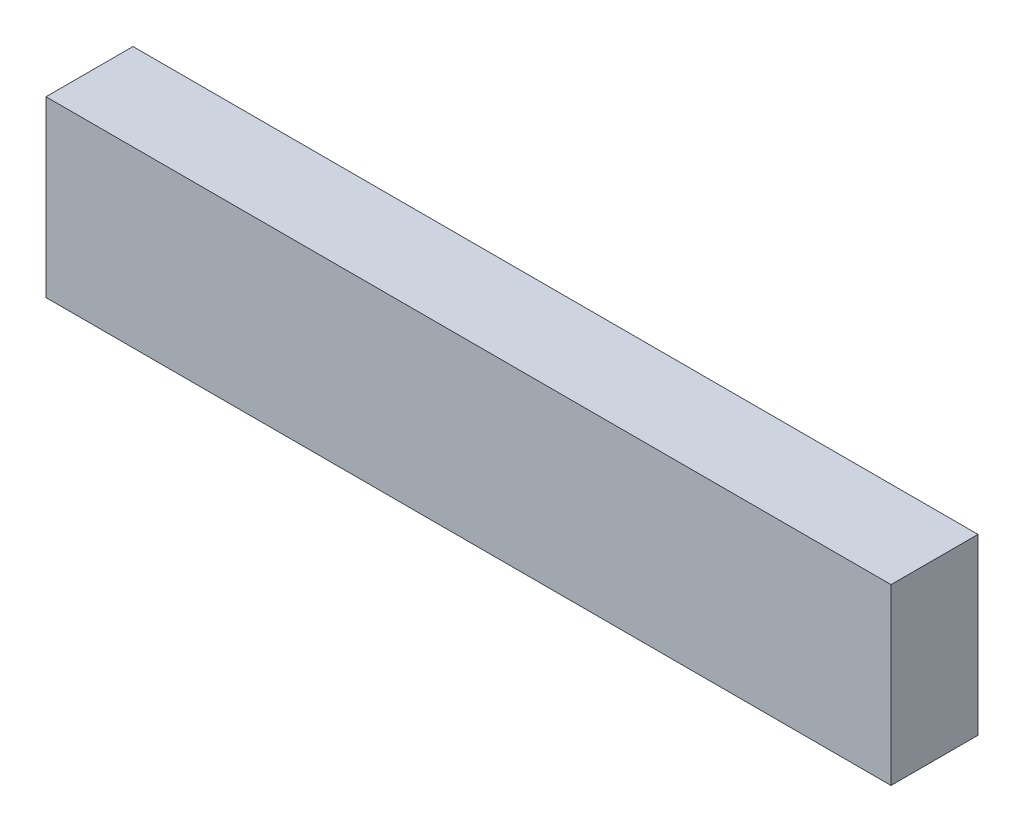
ISO-10303-21;
HEADER;
FILE_DESCRIPTION(('STEP AP214'),'2;1');
FILE_NAME('part.step','',(''),(''),'','','');
FILE_SCHEMA(('AUTOMOTIVE_DESIGN { 1 0 10303 214 1 1 1 1 }'));
ENDSEC;
DATA;
#1=APPLICATION_CONTEXT('core data for automotive mechanical design processes');
#2=APPLICATION_PROTOCOL_DEFINITION('international standard','automotive_design',2000,#1);
#3=PRODUCT_CONTEXT('',#1,'mechanical');
#4=PRODUCT('Part','Part','',(#3));
#5=PRODUCT_RELATED_PRODUCT_CATEGORY('part','',(#4));
#6=PRODUCT_DEFINITION_FORMATION('','',#4);
#7=PRODUCT_DEFINITION_CONTEXT('part definition',#1,'design');
#8=PRODUCT_DEFINITION('design','',#6,#7);
#9=PRODUCT_DEFINITION_SHAPE('','',#8);
#10=(LENGTH_UNIT() NAMED_UNIT(*) SI_UNIT(.MILLI.,.METRE.));
#11=(NAMED_UNIT(*) PLANE_ANGLE_UNIT() SI_UNIT($,.RADIAN.));
#12=(NAMED_UNIT(*) SI_UNIT($,.STERADIAN.) SOLID_ANGLE_UNIT());
#13=UNCERTAINTY_MEASURE_WITH_UNIT(LENGTH_MEASURE(1.E-05),#10,'distance_accuracy_value','');
#14=(GEOMETRIC_REPRESENTATION_CONTEXT(3) GLOBAL_UNCERTAINTY_ASSIGNED_CONTEXT((#13)) GLOBAL_UNIT_ASSIGNED_CONTEXT((#10,
#11,#12)) REPRESENTATION_CONTEXT('',''));
#15=CARTESIAN_POINT('',(0.,0.,0.));
#16=DIRECTION('',(0.,0.,1.));
#17=DIRECTION('',(1.,0.,0.));
#18=AXIS2_PLACEMENT_3D('',#15,#16,#17);
#19=CARTESIAN_POINT('',(-3.39999828,0.70000114,0.70000114));
#20=DIRECTION('',(0.,0.,1.));
#21=DIRECTION('',(1.,0.,0.));
#22=AXIS2_PLACEMENT_3D('',#19,#20,#21);
#23=PLANE('',#22);
#24=DIRECTION('',(0.,1.,0.));
#25=VECTOR('',#24,1.);
#26=CARTESIAN_POINT('',(3.40000082,0.70000114,0.70000114));
#27=LINE('',#26,#25);
#28=CARTESIAN_POINT('',(3.40000082,0.70000114,0.70000114));
#29=VERTEX_POINT('',#28);
#30=CARTESIAN_POINT('',(3.40000082,-0.6999986,0.70000114));
#31=VERTEX_POINT('',#30);
#32=EDGE_CURVE('E53',#29,#31,#27,.F.);
#33=ORIENTED_EDGE('',*,*,#32,.F.);
#34=DIRECTION('',(1.,0.,0.));
#35=VECTOR('',#34,1.);
#36=CARTESIAN_POINT('',(-3.39999828,0.70000114,0.70000114));
#37=LINE('',#36,#35);
#38=CARTESIAN_POINT('',(-3.39999828,0.70000114,0.70000114));
#39=VERTEX_POINT('',#38);
#40=EDGE_CURVE('E68',#39,#29,#37,.T.);
#41=ORIENTED_EDGE('',*,*,#40,.F.);
#42=DIRECTION('',(0.,1.,0.));
#43=VECTOR('',#42,1.);
#44=CARTESIAN_POINT('',(-3.39999828,-0.6999986,0.70000114));
#45=LINE('',#44,#43);
#46=CARTESIAN_POINT('',(-3.39999828,-0.6999986,0.70000114));
#47=VERTEX_POINT('',#46);
#48=EDGE_CURVE('E20',#47,#39,#45,.T.);
#49=ORIENTED_EDGE('',*,*,#48,.F.);
#50=DIRECTION('',(1.,0.,0.));
#51=VECTOR('',#50,1.);
#52=CARTESIAN_POINT('',(3.40000082,-0.6999986,0.70000114));
#53=LINE('',#52,#51);
#54=EDGE_CURVE('E58',#31,#47,#53,.F.);
#55=ORIENTED_EDGE('',*,*,#54,.F.);
#56=EDGE_LOOP('',(#33,#41,#49,#55));
#57=FACE_BOUND('',#56,.T.);
#58=ADVANCED_FACE('F17',(#57),#23,.T.);
#59=CARTESIAN_POINT('',(-3.39999828,-0.6999986,0.));
#60=DIRECTION('',(-1.,0.,0.));
#61=DIRECTION('',(0.,0.,1.));
#62=AXIS2_PLACEMENT_3D('',#59,#60,#61);
#63=PLANE('',#62);
#64=DIRECTION('',(0.,0.,1.));
#65=VECTOR('',#64,1.);
#66=CARTESIAN_POINT('',(-3.39999828,0.70000114,0.));
#67=LINE('',#66,#65);
#68=CARTESIAN_POINT('',(-3.39999828,0.70000114,0.));
#69=VERTEX_POINT('',#68);
#70=EDGE_CURVE('E79',#69,#39,#67,.T.);
#71=ORIENTED_EDGE('',*,*,#70,.F.);
#72=DIRECTION('',(0.,1.,0.));
#73=VECTOR('',#72,1.);
#74=CARTESIAN_POINT('',(-3.39999828,0.70000114,0.));
#75=LINE('',#74,#73);
#76=CARTESIAN_POINT('',(-3.39999828,-0.6999986,0.));
#77=VERTEX_POINT('',#76);
#78=EDGE_CURVE('E74',#69,#77,#75,.F.);
#79=ORIENTED_EDGE('',*,*,#78,.T.);
#80=DIRECTION('',(0.,0.,-1.));
#81=VECTOR('',#80,1.);
#82=CARTESIAN_POINT('',(-3.39999828,-0.6999986,0.));
#83=LINE('',#82,#81);
#84=EDGE_CURVE('E63',#47,#77,#83,.T.);
#85=ORIENTED_EDGE('',*,*,#84,.F.);
#86=ORIENTED_EDGE('',*,*,#48,.T.);
#87=EDGE_LOOP('',(#71,#79,#85,#86));
#88=FACE_BOUND('',#87,.T.);
#89=ADVANCED_FACE('F73',(#88),#63,.T.);
#90=CARTESIAN_POINT('',(3.40000082,-0.6999986,0.));
#91=DIRECTION('',(0.,-1.,0.));
#92=DIRECTION('',(0.,0.,-1.));
#93=AXIS2_PLACEMENT_3D('',#90,#91,#92);
#94=PLANE('',#93);
#95=ORIENTED_EDGE('',*,*,#84,.T.);
#96=DIRECTION('',(1.,0.,0.));
#97=VECTOR('',#96,1.);
#98=CARTESIAN_POINT('',(-3.39999828,-0.6999986,0.));
#99=LINE('',#98,#97);
#100=CARTESIAN_POINT('',(3.40000082,-0.6999986,0.));
#101=VERTEX_POINT('',#100);
#102=EDGE_CURVE('E84',#77,#101,#99,.T.);
#103=ORIENTED_EDGE('',*,*,#102,.T.);
#104=DIRECTION('',(0.,0.,-1.));
#105=VECTOR('',#104,1.);
#106=CARTESIAN_POINT('',(3.40000082,-0.6999986,0.));
#107=LINE('',#106,#105);
#108=EDGE_CURVE('E65',#31,#101,#107,.T.);
#109=ORIENTED_EDGE('',*,*,#108,.F.);
#110=ORIENTED_EDGE('',*,*,#54,.T.);
#111=EDGE_LOOP('',(#95,#103,#109,#110));
#112=FACE_BOUND('',#111,.T.);
#113=ADVANCED_FACE('F60',(#112),#94,.T.);
#114=CARTESIAN_POINT('',(3.40000082,0.70000114,0.));
#115=DIRECTION('',(1.,0.,0.));
#116=DIRECTION('',(0.,0.,-1.));
#117=AXIS2_PLACEMENT_3D('',#114,#115,#116);
#118=PLANE('',#117);
#119=ORIENTED_EDGE('',*,*,#108,.T.);
#120=DIRECTION('',(0.,1.,0.));
#121=VECTOR('',#120,1.);
#122=CARTESIAN_POINT('',(3.40000082,0.70000114,0.));
#123=LINE('',#122,#121);
#124=CARTESIAN_POINT('',(3.40000082,0.70000114,0.));
#125=VERTEX_POINT('',#124);
#126=EDGE_CURVE('E26',#101,#125,#123,.T.);
#127=ORIENTED_EDGE('',*,*,#126,.T.);
#128=DIRECTION('',(0.,0.,1.));
#129=VECTOR('',#128,1.);
#130=CARTESIAN_POINT('',(3.40000082,0.70000114,0.));
#131=LINE('',#130,#129);
#132=EDGE_CURVE('E34',#29,#125,#131,.F.);
#133=ORIENTED_EDGE('',*,*,#132,.F.);
#134=ORIENTED_EDGE('',*,*,#32,.T.);
#135=EDGE_LOOP('',(#119,#127,#133,#134));
#136=FACE_BOUND('',#135,.T.);
#137=ADVANCED_FACE('F88',(#136),#118,.T.);
#138=CARTESIAN_POINT('',(-3.39999828,0.70000114,0.));
#139=DIRECTION('',(0.,1.,0.));
#140=DIRECTION('',(0.,0.,1.));
#141=AXIS2_PLACEMENT_3D('',#138,#139,#140);
#142=PLANE('',#141);
#143=ORIENTED_EDGE('',*,*,#132,.T.);
#144=DIRECTION('',(1.,0.,0.));
#145=VECTOR('',#144,1.);
#146=CARTESIAN_POINT('',(-3.39999828,0.70000114,0.));
#147=LINE('',#146,#145);
#148=EDGE_CURVE('E11',#125,#69,#147,.F.);
#149=ORIENTED_EDGE('',*,*,#148,.T.);
#150=ORIENTED_EDGE('',*,*,#70,.T.);
#151=ORIENTED_EDGE('',*,*,#40,.T.);
#152=EDGE_LOOP('',(#143,#149,#150,#151));
#153=FACE_BOUND('',#152,.T.);
#154=ADVANCED_FACE('F91',(#153),#142,.T.);
#155=CARTESIAN_POINT('',(-3.39999828,0.70000114,0.));
#156=DIRECTION('',(0.,0.,1.));
#157=DIRECTION('',(1.,0.,0.));
#158=AXIS2_PLACEMENT_3D('',#155,#156,#157);
#159=PLANE('',#158);
#160=ORIENTED_EDGE('',*,*,#126,.F.);
#161=ORIENTED_EDGE('',*,*,#102,.F.);
#162=ORIENTED_EDGE('',*,*,#78,.F.);
#163=ORIENTED_EDGE('',*,*,#148,.F.);
#164=EDGE_LOOP('',(#160,#161,#162,#163));
#165=FACE_BOUND('',#164,.T.);
#166=ADVANCED_FACE('F90',(#165),#159,.F.);
#167=CLOSED_SHELL('',(#58,#89,#113,#137,#154,#166));
#168=MANIFOLD_SOLID_BREP('B1',#167);
#169=ADVANCED_BREP_SHAPE_REPRESENTATION('',(#18,#168),#14);
#170=SHAPE_DEFINITION_REPRESENTATION(#9,#169);
ENDSEC;
END-ISO-10303-21;
